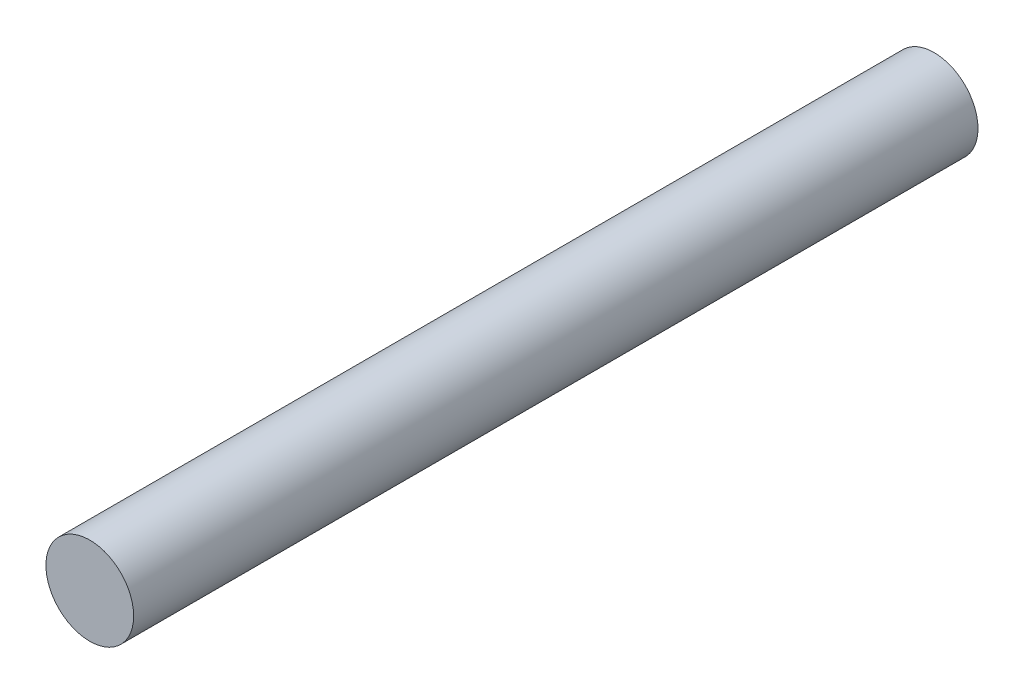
ISO-10303-21;
HEADER;
FILE_DESCRIPTION(('STEP AP214'),'2;1');
FILE_NAME('part.step','',(''),(''),'','','');
FILE_SCHEMA(('AUTOMOTIVE_DESIGN { 1 0 10303 214 1 1 1 1 }'));
ENDSEC;
DATA;
#1=APPLICATION_CONTEXT('core data for automotive mechanical design processes');
#2=APPLICATION_PROTOCOL_DEFINITION('international standard','automotive_design',2000,#1);
#3=PRODUCT_CONTEXT('',#1,'mechanical');
#4=PRODUCT('Part','Part','',(#3));
#5=PRODUCT_RELATED_PRODUCT_CATEGORY('part','',(#4));
#6=PRODUCT_DEFINITION_FORMATION('','',#4);
#7=PRODUCT_DEFINITION_CONTEXT('part definition',#1,'design');
#8=PRODUCT_DEFINITION('design','',#6,#7);
#9=PRODUCT_DEFINITION_SHAPE('','',#8);
#10=(LENGTH_UNIT() NAMED_UNIT(*) SI_UNIT(.MILLI.,.METRE.));
#11=(NAMED_UNIT(*) PLANE_ANGLE_UNIT() SI_UNIT($,.RADIAN.));
#12=(NAMED_UNIT(*) SI_UNIT($,.STERADIAN.) SOLID_ANGLE_UNIT());
#13=UNCERTAINTY_MEASURE_WITH_UNIT(LENGTH_MEASURE(1.E-05),#10,'distance_accuracy_value','');
#14=(GEOMETRIC_REPRESENTATION_CONTEXT(3) GLOBAL_UNCERTAINTY_ASSIGNED_CONTEXT((#13)) GLOBAL_UNIT_ASSIGNED_CONTEXT((#10,
#11,#12)) REPRESENTATION_CONTEXT('',''));
#15=CARTESIAN_POINT('',(0.,0.,0.));
#16=DIRECTION('',(0.,0.,1.));
#17=DIRECTION('',(1.,0.,0.));
#18=AXIS2_PLACEMENT_3D('',#15,#16,#17);
#19=CARTESIAN_POINT('',(0.,0.,0.));
#20=DIRECTION('',(0.,0.,1.));
#21=DIRECTION('',(1.,0.,0.));
#22=AXIS2_PLACEMENT_3D('',#19,#20,#21);
#23=CYLINDRICAL_SURFACE('',#22,2.);
#24=CARTESIAN_POINT('',(0.,0.,0.));
#25=DIRECTION('',(0.,0.,1.));
#26=DIRECTION('',(1.,0.,0.));
#27=AXIS2_PLACEMENT_3D('',#24,#25,#26);
#28=CIRCLE('',#27,2.);
#29=CARTESIAN_POINT('',(2.,0.,0.));
#30=VERTEX_POINT('',#29);
#31=EDGE_CURVE('E8',#30,#30,#28,.T.);
#32=ORIENTED_EDGE('',*,*,#31,.T.);
#33=EDGE_LOOP('',(#32));
#34=FACE_BOUND('',#33,.T.);
#35=CARTESIAN_POINT('',(0.,0.,38.5));
#36=DIRECTION('',(0.,0.,1.));
#37=DIRECTION('',(1.,0.,0.));
#38=AXIS2_PLACEMENT_3D('',#35,#36,#37);
#39=CIRCLE('',#38,2.);
#40=CARTESIAN_POINT('',(2.,0.,38.5));
#41=VERTEX_POINT('',#40);
#42=EDGE_CURVE('E18',#41,#41,#39,.T.);
#43=ORIENTED_EDGE('',*,*,#42,.F.);
#44=EDGE_LOOP('',(#43));
#45=FACE_BOUND('',#44,.T.);
#46=ADVANCED_FACE('F12',(#34,#45),#23,.T.);
#47=CARTESIAN_POINT('',(0.,0.,0.));
#48=DIRECTION('',(0.,0.,1.));
#49=DIRECTION('',(1.,0.,0.));
#50=AXIS2_PLACEMENT_3D('',#47,#48,#49);
#51=PLANE('',#50);
#52=ORIENTED_EDGE('',*,*,#31,.F.);
#53=EDGE_LOOP('',(#52));
#54=FACE_BOUND('',#53,.T.);
#55=ADVANCED_FACE('F27',(#54),#51,.F.);
#56=CARTESIAN_POINT('',(0.,0.,38.5));
#57=DIRECTION('',(0.,0.,1.));
#58=DIRECTION('',(1.,0.,0.));
#59=AXIS2_PLACEMENT_3D('',#56,#57,#58);
#60=PLANE('',#59);
#61=ORIENTED_EDGE('',*,*,#42,.T.);
#62=EDGE_LOOP('',(#61));
#63=FACE_BOUND('',#62,.T.);
#64=ADVANCED_FACE('F24',(#63),#60,.T.);
#65=CLOSED_SHELL('',(#46,#55,#64));
#66=MANIFOLD_SOLID_BREP('B1',#65);
#67=ADVANCED_BREP_SHAPE_REPRESENTATION('',(#18,#66),#14);
#68=SHAPE_DEFINITION_REPRESENTATION(#9,#67);
ENDSEC;
END-ISO-10303-21;
